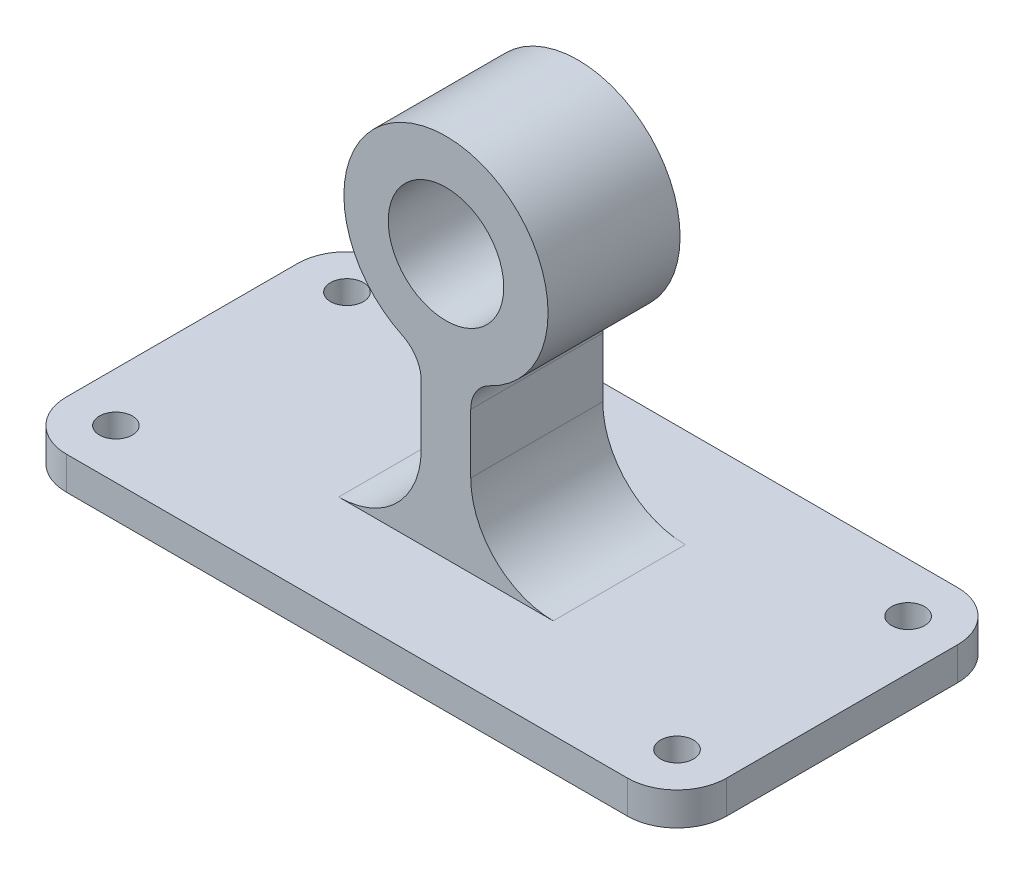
ISO-10303-21;
HEADER;
FILE_DESCRIPTION(('STEP AP214'),'2;1');
FILE_NAME('part.step','',(''),(''),'','','');
FILE_SCHEMA(('AUTOMOTIVE_DESIGN { 1 0 10303 214 1 1 1 1 }'));
ENDSEC;
DATA;
#1=APPLICATION_CONTEXT('core data for automotive mechanical design processes');
#2=APPLICATION_PROTOCOL_DEFINITION('international standard','automotive_design',2000,#1);
#3=PRODUCT_CONTEXT('',#1,'mechanical');
#4=PRODUCT('Part','Part','',(#3));
#5=PRODUCT_RELATED_PRODUCT_CATEGORY('part','',(#4));
#6=PRODUCT_DEFINITION_FORMATION('','',#4);
#7=PRODUCT_DEFINITION_CONTEXT('part definition',#1,'design');
#8=PRODUCT_DEFINITION('design','',#6,#7);
#9=PRODUCT_DEFINITION_SHAPE('','',#8);
#10=(LENGTH_UNIT() NAMED_UNIT(*) SI_UNIT(.MILLI.,.METRE.));
#11=(NAMED_UNIT(*) PLANE_ANGLE_UNIT() SI_UNIT($,.RADIAN.));
#12=(NAMED_UNIT(*) SI_UNIT($,.STERADIAN.) SOLID_ANGLE_UNIT());
#13=UNCERTAINTY_MEASURE_WITH_UNIT(LENGTH_MEASURE(1.E-05),#10,'distance_accuracy_value','');
#14=(GEOMETRIC_REPRESENTATION_CONTEXT(3) GLOBAL_UNCERTAINTY_ASSIGNED_CONTEXT((#13)) GLOBAL_UNIT_ASSIGNED_CONTEXT((#10,
#11,#12)) REPRESENTATION_CONTEXT('',''));
#15=CARTESIAN_POINT('',(0.,0.,0.));
#16=DIRECTION('',(0.,0.,1.));
#17=DIRECTION('',(1.,0.,0.));
#18=AXIS2_PLACEMENT_3D('',#15,#16,#17);
#19=CARTESIAN_POINT('',(15.,10.,-15.));
#20=DIRECTION('',(0.,-1.,0.));
#21=DIRECTION('',(0.,0.,-1.));
#22=AXIS2_PLACEMENT_3D('',#19,#20,#21);
#23=PLANE('',#22);
#24=CARTESIAN_POINT('',(15.,10.,-15.));
#25=DIRECTION('',(0.,1.,0.));
#26=DIRECTION('',(0.,0.,1.));
#27=AXIS2_PLACEMENT_3D('',#24,#25,#26);
#28=CIRCLE('',#27,5.);
#29=CARTESIAN_POINT('',(15.,10.,-10.));
#30=VERTEX_POINT('',#29);
#31=EDGE_CURVE('E246',#30,#30,#28,.T.);
#32=ORIENTED_EDGE('',*,*,#31,.F.);
#33=EDGE_LOOP('',(#32));
#34=FACE_BOUND('',#33,.T.);
#35=CARTESIAN_POINT('',(185.,10.,-85.));
#36=DIRECTION('',(0.,1.,0.));
#37=DIRECTION('',(0.,0.,1.));
#38=AXIS2_PLACEMENT_3D('',#35,#36,#37);
#39=CIRCLE('',#38,5.00000000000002);
#40=CARTESIAN_POINT('',(185.,10.,-80.));
#41=VERTEX_POINT('',#40);
#42=EDGE_CURVE('E255',#41,#41,#39,.T.);
#43=ORIENTED_EDGE('',*,*,#42,.F.);
#44=EDGE_LOOP('',(#43));
#45=FACE_BOUND('',#44,.T.);
#46=CARTESIAN_POINT('',(15.,10.,-85.));
#47=DIRECTION('',(0.,1.,0.));
#48=DIRECTION('',(0.,0.,1.));
#49=AXIS2_PLACEMENT_3D('',#46,#47,#48);
#50=CIRCLE('',#49,5.);
#51=CARTESIAN_POINT('',(15.,10.,-80.));
#52=VERTEX_POINT('',#51);
#53=EDGE_CURVE('E261',#52,#52,#50,.T.);
#54=ORIENTED_EDGE('',*,*,#53,.F.);
#55=EDGE_LOOP('',(#54));
#56=FACE_BOUND('',#55,.T.);
#57=CARTESIAN_POINT('',(185.,10.,-15.));
#58=DIRECTION('',(0.,1.,0.));
#59=DIRECTION('',(0.,0.,1.));
#60=AXIS2_PLACEMENT_3D('',#57,#58,#59);
#61=CIRCLE('',#60,5.00000000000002);
#62=CARTESIAN_POINT('',(185.,10.,-9.99999999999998));
#63=VERTEX_POINT('',#62);
#64=EDGE_CURVE('E267',#63,#63,#61,.T.);
#65=ORIENTED_EDGE('',*,*,#64,.F.);
#66=EDGE_LOOP('',(#65));
#67=FACE_BOUND('',#66,.T.);
#68=CARTESIAN_POINT('',(15.,10.,-15.));
#69=DIRECTION('',(0.,1.,0.));
#70=DIRECTION('',(0.,0.,-1.));
#71=AXIS2_PLACEMENT_3D('',#68,#69,#70);
#72=CIRCLE('',#71,15.);
#73=CARTESIAN_POINT('',(0.,10.,-15.0000000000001));
#74=VERTEX_POINT('',#73);
#75=CARTESIAN_POINT('',(15.0000000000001,10.,0.));
#76=VERTEX_POINT('',#75);
#77=EDGE_CURVE('E161',#74,#76,#72,.T.);
#78=ORIENTED_EDGE('',*,*,#77,.T.);
#79=DIRECTION('',(1.,0.,0.));
#80=VECTOR('',#79,1.);
#81=CARTESIAN_POINT('',(15.0000000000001,10.,0.));
#82=LINE('',#81,#80);
#83=CARTESIAN_POINT('',(185.,10.,0.));
#84=VERTEX_POINT('',#83);
#85=EDGE_CURVE('E150',#76,#84,#82,.T.);
#86=ORIENTED_EDGE('',*,*,#85,.T.);
#87=CARTESIAN_POINT('',(185.,10.,-15.));
#88=DIRECTION('',(0.,1.,0.));
#89=DIRECTION('',(0.,0.,1.));
#90=AXIS2_PLACEMENT_3D('',#87,#88,#89);
#91=CIRCLE('',#90,15.);
#92=CARTESIAN_POINT('',(200.,10.,-15.0000000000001));
#93=VERTEX_POINT('',#92);
#94=EDGE_CURVE('E160',#84,#93,#91,.T.);
#95=ORIENTED_EDGE('',*,*,#94,.T.);
#96=DIRECTION('',(0.,0.,-1.));
#97=VECTOR('',#96,1.);
#98=CARTESIAN_POINT('',(200.,10.,-15.0000000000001));
#99=LINE('',#98,#97);
#100=CARTESIAN_POINT('',(200.,10.,-84.9999999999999));
#101=VERTEX_POINT('',#100);
#102=EDGE_CURVE('E273',#93,#101,#99,.T.);
#103=ORIENTED_EDGE('',*,*,#102,.T.);
#104=CARTESIAN_POINT('',(185.,10.,-85.));
#105=DIRECTION('',(0.,1.,0.));
#106=DIRECTION('',(0.,0.,1.));
#107=AXIS2_PLACEMENT_3D('',#104,#105,#106);
#108=CIRCLE('',#107,15.);
#109=CARTESIAN_POINT('',(185.,10.,-100.));
#110=VERTEX_POINT('',#109);
#111=EDGE_CURVE('E275',#101,#110,#108,.T.);
#112=ORIENTED_EDGE('',*,*,#111,.T.);
#113=DIRECTION('',(-1.,0.,0.));
#114=VECTOR('',#113,1.);
#115=CARTESIAN_POINT('',(15.0000000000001,10.,-100.));
#116=LINE('',#115,#114);
#117=CARTESIAN_POINT('',(15.0000000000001,10.,-100.));
#118=VERTEX_POINT('',#117);
#119=EDGE_CURVE('E277',#110,#118,#116,.T.);
#120=ORIENTED_EDGE('',*,*,#119,.T.);
#121=CARTESIAN_POINT('',(15.,10.,-85.));
#122=DIRECTION('',(0.,1.,0.));
#123=DIRECTION('',(0.,0.,-1.));
#124=AXIS2_PLACEMENT_3D('',#121,#122,#123);
#125=CIRCLE('',#124,15.);
#126=CARTESIAN_POINT('',(0.,10.,-84.9999999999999));
#127=VERTEX_POINT('',#126);
#128=EDGE_CURVE('E279',#118,#127,#125,.T.);
#129=ORIENTED_EDGE('',*,*,#128,.T.);
#130=DIRECTION('',(0.,0.,1.));
#131=VECTOR('',#130,1.);
#132=CARTESIAN_POINT('',(0.,10.,-15.0000000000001));
#133=LINE('',#132,#131);
#134=EDGE_CURVE('E166',#127,#74,#133,.T.);
#135=ORIENTED_EDGE('',*,*,#134,.T.);
#136=EDGE_LOOP('',(#78,#86,#95,#103,#112,#120,#129,#135));
#137=FACE_BOUND('',#136,.T.);
#138=DIRECTION('',(1.,0.,0.));
#139=VECTOR('',#138,1.);
#140=CARTESIAN_POINT('',(92.5,10.,-30.));
#141=LINE('',#140,#139);
#142=CARTESIAN_POINT('',(67.5,10.,-30.));
#143=VERTEX_POINT('',#142);
#144=CARTESIAN_POINT('',(132.5,10.,-30.));
#145=VERTEX_POINT('',#144);
#146=EDGE_CURVE('E569',#143,#145,#141,.T.);
#147=ORIENTED_EDGE('',*,*,#146,.F.);
#148=DIRECTION('',(0.,0.,1.));
#149=VECTOR('',#148,1.);
#150=CARTESIAN_POINT('',(67.5,10.,-70.));
#151=LINE('',#150,#149);
#152=CARTESIAN_POINT('',(67.5,10.,-70.));
#153=VERTEX_POINT('',#152);
#154=EDGE_CURVE('E186',#143,#153,#151,.F.);
#155=ORIENTED_EDGE('',*,*,#154,.T.);
#156=DIRECTION('',(-1.,0.,0.));
#157=VECTOR('',#156,1.);
#158=CARTESIAN_POINT('',(92.5,10.,-70.));
#159=LINE('',#158,#157);
#160=CARTESIAN_POINT('',(132.5,10.,-70.));
#161=VERTEX_POINT('',#160);
#162=EDGE_CURVE('E566',#161,#153,#159,.T.);
#163=ORIENTED_EDGE('',*,*,#162,.F.);
#164=DIRECTION('',(0.,0.,-1.));
#165=VECTOR('',#164,1.);
#166=CARTESIAN_POINT('',(132.5,10.,-30.));
#167=LINE('',#166,#165);
#168=EDGE_CURVE('E178',#161,#145,#167,.F.);
#169=ORIENTED_EDGE('',*,*,#168,.T.);
#170=EDGE_LOOP('',(#147,#155,#163,#169));
#171=FACE_BOUND('',#170,.T.);
#172=ADVANCED_FACE('F39',(#34,#45,#56,#67,#137,#171),#23,.F.);
#173=CARTESIAN_POINT('',(15.,0.,-15.));
#174=DIRECTION('',(0.,-1.,0.));
#175=DIRECTION('',(0.,0.,-1.));
#176=AXIS2_PLACEMENT_3D('',#173,#174,#175);
#177=PLANE('',#176);
#178=CARTESIAN_POINT('',(185.,0.,-85.));
#179=DIRECTION('',(0.,1.,0.));
#180=DIRECTION('',(0.,0.,1.));
#181=AXIS2_PLACEMENT_3D('',#178,#179,#180);
#182=CIRCLE('',#181,5.00000000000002);
#183=CARTESIAN_POINT('',(185.,0.,-80.));
#184=VERTEX_POINT('',#183);
#185=EDGE_CURVE('E253',#184,#184,#182,.T.);
#186=ORIENTED_EDGE('',*,*,#185,.T.);
#187=EDGE_LOOP('',(#186));
#188=FACE_BOUND('',#187,.T.);
#189=CARTESIAN_POINT('',(185.,0.,-15.));
#190=DIRECTION('',(0.,1.,0.));
#191=DIRECTION('',(0.,0.,1.));
#192=AXIS2_PLACEMENT_3D('',#189,#190,#191);
#193=CIRCLE('',#192,5.00000000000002);
#194=CARTESIAN_POINT('',(185.,0.,-9.99999999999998));
#195=VERTEX_POINT('',#194);
#196=EDGE_CURVE('E264',#195,#195,#193,.T.);
#197=ORIENTED_EDGE('',*,*,#196,.T.);
#198=EDGE_LOOP('',(#197));
#199=FACE_BOUND('',#198,.T.);
#200=CARTESIAN_POINT('',(15.,0.,-15.));
#201=DIRECTION('',(0.,1.,0.));
#202=DIRECTION('',(0.,0.,-1.));
#203=AXIS2_PLACEMENT_3D('',#200,#201,#202);
#204=CIRCLE('',#203,15.);
#205=CARTESIAN_POINT('',(0.,0.,-15.0000000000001));
#206=VERTEX_POINT('',#205);
#207=CARTESIAN_POINT('',(15.0000000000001,0.,0.));
#208=VERTEX_POINT('',#207);
#209=EDGE_CURVE('E174',#206,#208,#204,.T.);
#210=ORIENTED_EDGE('',*,*,#209,.F.);
#211=DIRECTION('',(0.,0.,1.));
#212=VECTOR('',#211,1.);
#213=CARTESIAN_POINT('',(0.,0.,-15.0000000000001));
#214=LINE('',#213,#212);
#215=CARTESIAN_POINT('',(0.,0.,-84.9999999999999));
#216=VERTEX_POINT('',#215);
#217=EDGE_CURVE('E170',#216,#206,#214,.T.);
#218=ORIENTED_EDGE('',*,*,#217,.F.);
#219=CARTESIAN_POINT('',(15.,0.,-85.));
#220=DIRECTION('',(0.,1.,0.));
#221=DIRECTION('',(0.,0.,-1.));
#222=AXIS2_PLACEMENT_3D('',#219,#220,#221);
#223=CIRCLE('',#222,15.);
#224=CARTESIAN_POINT('',(15.0000000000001,0.,-100.));
#225=VERTEX_POINT('',#224);
#226=EDGE_CURVE('E294',#225,#216,#223,.T.);
#227=ORIENTED_EDGE('',*,*,#226,.F.);
#228=DIRECTION('',(-1.,0.,0.));
#229=VECTOR('',#228,1.);
#230=CARTESIAN_POINT('',(15.0000000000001,0.,-100.));
#231=LINE('',#230,#229);
#232=CARTESIAN_POINT('',(185.,0.,-100.));
#233=VERTEX_POINT('',#232);
#234=EDGE_CURVE('E292',#233,#225,#231,.T.);
#235=ORIENTED_EDGE('',*,*,#234,.F.);
#236=CARTESIAN_POINT('',(185.,0.,-85.));
#237=DIRECTION('',(0.,1.,0.));
#238=DIRECTION('',(0.,0.,1.));
#239=AXIS2_PLACEMENT_3D('',#236,#237,#238);
#240=CIRCLE('',#239,15.);
#241=CARTESIAN_POINT('',(200.,0.,-84.9999999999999));
#242=VERTEX_POINT('',#241);
#243=EDGE_CURVE('E290',#242,#233,#240,.T.);
#244=ORIENTED_EDGE('',*,*,#243,.F.);
#245=DIRECTION('',(0.,0.,-1.));
#246=VECTOR('',#245,1.);
#247=CARTESIAN_POINT('',(200.,0.,-15.0000000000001));
#248=LINE('',#247,#246);
#249=CARTESIAN_POINT('',(200.,0.,-15.0000000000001));
#250=VERTEX_POINT('',#249);
#251=EDGE_CURVE('E288',#250,#242,#248,.T.);
#252=ORIENTED_EDGE('',*,*,#251,.F.);
#253=CARTESIAN_POINT('',(185.,0.,-15.));
#254=DIRECTION('',(0.,1.,0.));
#255=DIRECTION('',(0.,0.,1.));
#256=AXIS2_PLACEMENT_3D('',#253,#254,#255);
#257=CIRCLE('',#256,15.);
#258=CARTESIAN_POINT('',(185.,0.,0.));
#259=VERTEX_POINT('',#258);
#260=EDGE_CURVE('E286',#259,#250,#257,.T.);
#261=ORIENTED_EDGE('',*,*,#260,.F.);
#262=DIRECTION('',(1.,0.,0.));
#263=VECTOR('',#262,1.);
#264=CARTESIAN_POINT('',(15.0000000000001,0.,0.));
#265=LINE('',#264,#263);
#266=EDGE_CURVE('E284',#208,#259,#265,.T.);
#267=ORIENTED_EDGE('',*,*,#266,.F.);
#268=EDGE_LOOP('',(#210,#218,#227,#235,#244,#252,#261,#267));
#269=FACE_BOUND('',#268,.T.);
#270=CARTESIAN_POINT('',(15.,0.,-85.));
#271=DIRECTION('',(0.,1.,0.));
#272=DIRECTION('',(0.,0.,1.));
#273=AXIS2_PLACEMENT_3D('',#270,#271,#272);
#274=CIRCLE('',#273,5.);
#275=CARTESIAN_POINT('',(15.,0.,-80.));
#276=VERTEX_POINT('',#275);
#277=EDGE_CURVE('E258',#276,#276,#274,.T.);
#278=ORIENTED_EDGE('',*,*,#277,.T.);
#279=EDGE_LOOP('',(#278));
#280=FACE_BOUND('',#279,.T.);
#281=CARTESIAN_POINT('',(15.,0.,-15.));
#282=DIRECTION('',(0.,1.,0.));
#283=DIRECTION('',(0.,0.,1.));
#284=AXIS2_PLACEMENT_3D('',#281,#282,#283);
#285=CIRCLE('',#284,5.);
#286=CARTESIAN_POINT('',(15.,0.,-10.));
#287=VERTEX_POINT('',#286);
#288=EDGE_CURVE('E242',#287,#287,#285,.T.);
#289=ORIENTED_EDGE('',*,*,#288,.T.);
#290=EDGE_LOOP('',(#289));
#291=FACE_BOUND('',#290,.T.);
#292=ADVANCED_FACE('F320',(#188,#199,#269,#280,#291),#177,.T.);
#293=CARTESIAN_POINT('',(15.,10.,-15.));
#294=DIRECTION('',(0.,-1.,0.));
#295=DIRECTION('',(0.,0.,-1.));
#296=AXIS2_PLACEMENT_3D('',#293,#294,#295);
#297=CYLINDRICAL_SURFACE('',#296,15.);
#298=ORIENTED_EDGE('',*,*,#209,.T.);
#299=DIRECTION('',(0.,-1.,0.));
#300=VECTOR('',#299,1.);
#301=CARTESIAN_POINT('',(15.0000000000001,10.,0.));
#302=LINE('',#301,#300);
#303=EDGE_CURVE('E154',#76,#208,#302,.T.);
#304=ORIENTED_EDGE('',*,*,#303,.F.);
#305=ORIENTED_EDGE('',*,*,#77,.F.);
#306=DIRECTION('',(0.,-1.,0.));
#307=VECTOR('',#306,1.);
#308=CARTESIAN_POINT('',(0.,10.,-15.0000000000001));
#309=LINE('',#308,#307);
#310=EDGE_CURVE('E282',#74,#206,#309,.T.);
#311=ORIENTED_EDGE('',*,*,#310,.T.);
#312=EDGE_LOOP('',(#298,#304,#305,#311));
#313=FACE_BOUND('',#312,.T.);
#314=ADVANCED_FACE('F172',(#313),#297,.T.);
#315=CARTESIAN_POINT('',(15.0000000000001,10.,0.));
#316=DIRECTION('',(0.,0.,-1.));
#317=DIRECTION('',(-1.,0.,0.));
#318=AXIS2_PLACEMENT_3D('',#315,#316,#317);
#319=PLANE('',#318);
#320=ORIENTED_EDGE('',*,*,#266,.T.);
#321=DIRECTION('',(0.,-1.,0.));
#322=VECTOR('',#321,1.);
#323=CARTESIAN_POINT('',(185.,10.,0.));
#324=LINE('',#323,#322);
#325=EDGE_CURVE('E157',#84,#259,#324,.T.);
#326=ORIENTED_EDGE('',*,*,#325,.F.);
#327=ORIENTED_EDGE('',*,*,#85,.F.);
#328=ORIENTED_EDGE('',*,*,#303,.T.);
#329=EDGE_LOOP('',(#320,#326,#327,#328));
#330=FACE_BOUND('',#329,.T.);
#331=ADVANCED_FACE('F152',(#330),#319,.F.);
#332=CARTESIAN_POINT('',(185.,10.,-15.));
#333=DIRECTION('',(0.,-1.,0.));
#334=DIRECTION('',(0.,0.,-1.));
#335=AXIS2_PLACEMENT_3D('',#332,#333,#334);
#336=CYLINDRICAL_SURFACE('',#335,15.);
#337=ORIENTED_EDGE('',*,*,#260,.T.);
#338=DIRECTION('',(0.,-1.,0.));
#339=VECTOR('',#338,1.);
#340=CARTESIAN_POINT('',(200.,10.,-15.0000000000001));
#341=LINE('',#340,#339);
#342=EDGE_CURVE('E180',#93,#250,#341,.T.);
#343=ORIENTED_EDGE('',*,*,#342,.F.);
#344=ORIENTED_EDGE('',*,*,#94,.F.);
#345=ORIENTED_EDGE('',*,*,#325,.T.);
#346=EDGE_LOOP('',(#337,#343,#344,#345));
#347=FACE_BOUND('',#346,.T.);
#348=ADVANCED_FACE('F334',(#347),#336,.T.);
#349=CARTESIAN_POINT('',(200.,10.,-15.0000000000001));
#350=DIRECTION('',(-1.,0.,0.));
#351=DIRECTION('',(0.,0.,1.));
#352=AXIS2_PLACEMENT_3D('',#349,#350,#351);
#353=PLANE('',#352);
#354=ORIENTED_EDGE('',*,*,#251,.T.);
#355=DIRECTION('',(0.,-1.,0.));
#356=VECTOR('',#355,1.);
#357=CARTESIAN_POINT('',(200.,10.,-84.9999999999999));
#358=LINE('',#357,#356);
#359=EDGE_CURVE('E307',#101,#242,#358,.T.);
#360=ORIENTED_EDGE('',*,*,#359,.F.);
#361=ORIENTED_EDGE('',*,*,#102,.F.);
#362=ORIENTED_EDGE('',*,*,#342,.T.);
#363=EDGE_LOOP('',(#354,#360,#361,#362));
#364=FACE_BOUND('',#363,.T.);
#365=ADVANCED_FACE('F314',(#364),#353,.F.);
#366=CARTESIAN_POINT('',(185.,10.,-85.));
#367=DIRECTION('',(0.,-1.,0.));
#368=DIRECTION('',(0.,0.,-1.));
#369=AXIS2_PLACEMENT_3D('',#366,#367,#368);
#370=CYLINDRICAL_SURFACE('',#369,15.);
#371=ORIENTED_EDGE('',*,*,#243,.T.);
#372=DIRECTION('',(0.,-1.,0.));
#373=VECTOR('',#372,1.);
#374=CARTESIAN_POINT('',(185.,10.,-100.));
#375=LINE('',#374,#373);
#376=EDGE_CURVE('E304',#110,#233,#375,.T.);
#377=ORIENTED_EDGE('',*,*,#376,.F.);
#378=ORIENTED_EDGE('',*,*,#111,.F.);
#379=ORIENTED_EDGE('',*,*,#359,.T.);
#380=EDGE_LOOP('',(#371,#377,#378,#379));
#381=FACE_BOUND('',#380,.T.);
#382=ADVANCED_FACE('F326',(#381),#370,.T.);
#383=CARTESIAN_POINT('',(15.0000000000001,10.,-100.));
#384=DIRECTION('',(0.,0.,1.));
#385=DIRECTION('',(1.,0.,0.));
#386=AXIS2_PLACEMENT_3D('',#383,#384,#385);
#387=PLANE('',#386);
#388=ORIENTED_EDGE('',*,*,#234,.T.);
#389=DIRECTION('',(0.,-1.,0.));
#390=VECTOR('',#389,1.);
#391=CARTESIAN_POINT('',(15.0000000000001,10.,-100.));
#392=LINE('',#391,#390);
#393=EDGE_CURVE('E301',#118,#225,#392,.T.);
#394=ORIENTED_EDGE('',*,*,#393,.F.);
#395=ORIENTED_EDGE('',*,*,#119,.F.);
#396=ORIENTED_EDGE('',*,*,#376,.T.);
#397=EDGE_LOOP('',(#388,#394,#395,#396));
#398=FACE_BOUND('',#397,.T.);
#399=ADVANCED_FACE('F330',(#398),#387,.F.);
#400=CARTESIAN_POINT('',(15.,10.,-85.));
#401=DIRECTION('',(0.,-1.,0.));
#402=DIRECTION('',(0.,0.,-1.));
#403=AXIS2_PLACEMENT_3D('',#400,#401,#402);
#404=CYLINDRICAL_SURFACE('',#403,15.);
#405=ORIENTED_EDGE('',*,*,#226,.T.);
#406=DIRECTION('',(0.,-1.,0.));
#407=VECTOR('',#406,1.);
#408=CARTESIAN_POINT('',(0.,10.,-84.9999999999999));
#409=LINE('',#408,#407);
#410=EDGE_CURVE('E298',#127,#216,#409,.T.);
#411=ORIENTED_EDGE('',*,*,#410,.F.);
#412=ORIENTED_EDGE('',*,*,#128,.F.);
#413=ORIENTED_EDGE('',*,*,#393,.T.);
#414=EDGE_LOOP('',(#405,#411,#412,#413));
#415=FACE_BOUND('',#414,.T.);
#416=ADVANCED_FACE('F360',(#415),#404,.T.);
#417=CARTESIAN_POINT('',(0.,10.,-15.0000000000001));
#418=DIRECTION('',(1.,0.,0.));
#419=DIRECTION('',(0.,0.,-1.));
#420=AXIS2_PLACEMENT_3D('',#417,#418,#419);
#421=PLANE('',#420);
#422=ORIENTED_EDGE('',*,*,#217,.T.);
#423=ORIENTED_EDGE('',*,*,#310,.F.);
#424=ORIENTED_EDGE('',*,*,#134,.F.);
#425=ORIENTED_EDGE('',*,*,#410,.T.);
#426=EDGE_LOOP('',(#422,#423,#424,#425));
#427=FACE_BOUND('',#426,.T.);
#428=ADVANCED_FACE('F357',(#427),#421,.F.);
#429=CARTESIAN_POINT('',(185.,10.,-15.));
#430=DIRECTION('',(0.,-1.,0.));
#431=DIRECTION('',(0.,0.,-1.));
#432=AXIS2_PLACEMENT_3D('',#429,#430,#431);
#433=CYLINDRICAL_SURFACE('',#432,5.00000000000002);
#434=ORIENTED_EDGE('',*,*,#64,.T.);
#435=EDGE_LOOP('',(#434));
#436=FACE_BOUND('',#435,.T.);
#437=ORIENTED_EDGE('',*,*,#196,.F.);
#438=EDGE_LOOP('',(#437));
#439=FACE_BOUND('',#438,.T.);
#440=ADVANCED_FACE('F354',(#436,#439),#433,.F.);
#441=CARTESIAN_POINT('',(15.,10.,-85.));
#442=DIRECTION('',(0.,-1.,0.));
#443=DIRECTION('',(0.,0.,-1.));
#444=AXIS2_PLACEMENT_3D('',#441,#442,#443);
#445=CYLINDRICAL_SURFACE('',#444,5.);
#446=ORIENTED_EDGE('',*,*,#53,.T.);
#447=EDGE_LOOP('',(#446));
#448=FACE_BOUND('',#447,.T.);
#449=ORIENTED_EDGE('',*,*,#277,.F.);
#450=EDGE_LOOP('',(#449));
#451=FACE_BOUND('',#450,.T.);
#452=ADVANCED_FACE('F390',(#448,#451),#445,.F.);
#453=CARTESIAN_POINT('',(185.,10.,-85.));
#454=DIRECTION('',(0.,-1.,0.));
#455=DIRECTION('',(0.,0.,-1.));
#456=AXIS2_PLACEMENT_3D('',#453,#454,#455);
#457=CYLINDRICAL_SURFACE('',#456,5.00000000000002);
#458=ORIENTED_EDGE('',*,*,#42,.T.);
#459=EDGE_LOOP('',(#458));
#460=FACE_BOUND('',#459,.T.);
#461=ORIENTED_EDGE('',*,*,#185,.F.);
#462=EDGE_LOOP('',(#461));
#463=FACE_BOUND('',#462,.T.);
#464=ADVANCED_FACE('F397',(#460,#463),#457,.F.);
#465=CARTESIAN_POINT('',(15.,10.,-15.));
#466=DIRECTION('',(0.,-1.,0.));
#467=DIRECTION('',(0.,0.,-1.));
#468=AXIS2_PLACEMENT_3D('',#465,#466,#467);
#469=CYLINDRICAL_SURFACE('',#468,5.);
#470=ORIENTED_EDGE('',*,*,#31,.T.);
#471=EDGE_LOOP('',(#470));
#472=FACE_BOUND('',#471,.T.);
#473=ORIENTED_EDGE('',*,*,#288,.F.);
#474=EDGE_LOOP('',(#473));
#475=FACE_BOUND('',#474,.T.);
#476=ADVANCED_FACE('F404',(#472,#475),#469,.F.);
#477=CARTESIAN_POINT('',(107.5,60.,-30.));
#478=DIRECTION('',(-1.,0.,0.));
#479=DIRECTION('',(0.,0.,1.));
#480=AXIS2_PLACEMENT_3D('',#477,#478,#479);
#481=PLANE('',#480);
#482=DIRECTION('',(0.,-1.,0.));
#483=VECTOR('',#482,1.);
#484=CARTESIAN_POINT('',(107.5,60.,-70.));
#485=LINE('',#484,#483);
#486=CARTESIAN_POINT('',(107.5,53.0072190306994,-70.));
#487=VERTEX_POINT('',#486);
#488=CARTESIAN_POINT('',(107.5,35.,-70.));
#489=VERTEX_POINT('',#488);
#490=EDGE_CURVE('E237',#487,#489,#485,.T.);
#491=ORIENTED_EDGE('',*,*,#490,.F.);
#492=DIRECTION('',(0.,0.,1.));
#493=VECTOR('',#492,1.);
#494=CARTESIAN_POINT('',(107.5,53.0072190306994,-30.));
#495=LINE('',#494,#493);
#496=CARTESIAN_POINT('',(107.5,53.0072190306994,-30.));
#497=VERTEX_POINT('',#496);
#498=EDGE_CURVE('E210',#487,#497,#495,.T.);
#499=ORIENTED_EDGE('',*,*,#498,.T.);
#500=DIRECTION('',(0.,-1.,0.));
#501=VECTOR('',#500,1.);
#502=CARTESIAN_POINT('',(107.5,60.,-30.));
#503=LINE('',#502,#501);
#504=CARTESIAN_POINT('',(107.5,35.,-30.));
#505=VERTEX_POINT('',#504);
#506=EDGE_CURVE('E221',#497,#505,#503,.T.);
#507=ORIENTED_EDGE('',*,*,#506,.T.);
#508=DIRECTION('',(0.,0.,-1.));
#509=VECTOR('',#508,1.);
#510=CARTESIAN_POINT('',(107.5,35.,-70.));
#511=LINE('',#510,#509);
#512=EDGE_CURVE('E189',#505,#489,#511,.T.);
#513=ORIENTED_EDGE('',*,*,#512,.T.);
#514=EDGE_LOOP('',(#491,#499,#507,#513));
#515=FACE_BOUND('',#514,.T.);
#516=ADVANCED_FACE('F240',(#515),#481,.F.);
#517=CARTESIAN_POINT('',(92.5,60.,-70.));
#518=DIRECTION('',(0.,0.,1.));
#519=DIRECTION('',(1.,0.,0.));
#520=AXIS2_PLACEMENT_3D('',#517,#518,#519);
#521=PLANE('',#520);
#522=CARTESIAN_POINT('',(100.,90.,-70.));
#523=DIRECTION('',(0.,0.,1.));
#524=DIRECTION('',(1.,0.,0.));
#525=AXIS2_PLACEMENT_3D('',#522,#523,#524);
#526=CIRCLE('',#525,17.5);
#527=CARTESIAN_POINT('',(117.5,90.,-70.));
#528=VERTEX_POINT('',#527);
#529=EDGE_CURVE('E231',#528,#528,#526,.T.);
#530=ORIENTED_EDGE('',*,*,#529,.T.);
#531=EDGE_LOOP('',(#530));
#532=FACE_BOUND('',#531,.T.);
#533=DIRECTION('',(0.,-1.,0.));
#534=VECTOR('',#533,1.);
#535=CARTESIAN_POINT('',(92.5,60.,-70.));
#536=LINE('',#535,#534);
#537=CARTESIAN_POINT('',(92.5,53.0072190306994,-70.));
#538=VERTEX_POINT('',#537);
#539=CARTESIAN_POINT('',(92.5,35.,-70.));
#540=VERTEX_POINT('',#539);
#541=EDGE_CURVE('E243',#538,#540,#536,.T.);
#542=ORIENTED_EDGE('',*,*,#541,.F.);
#543=CARTESIAN_POINT('',(82.5,53.0072190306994,-70.));
#544=DIRECTION('',(0.,0.,1.));
#545=DIRECTION('',(1.,0.,0.));
#546=AXIS2_PLACEMENT_3D('',#543,#544,#545);
#547=CIRCLE('',#546,10.);
#548=CARTESIAN_POINT('',(86.7762932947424,62.0467608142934,-70.));
#549=VERTEX_POINT('',#548);
#550=EDGE_CURVE('E11',#538,#549,#547,.T.);
#551=ORIENTED_EDGE('',*,*,#550,.T.);
#552=CARTESIAN_POINT('',(100.,90.,-70.));
#553=DIRECTION('',(0.,0.,1.));
#554=DIRECTION('',(1.,0.,0.));
#555=AXIS2_PLACEMENT_3D('',#552,#553,#554);
#556=CIRCLE('',#555,30.9232921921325);
#557=CARTESIAN_POINT('',(113.223706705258,62.0467608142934,-70.));
#558=VERTEX_POINT('',#557);
#559=EDGE_CURVE('E230',#558,#549,#556,.T.);
#560=ORIENTED_EDGE('',*,*,#559,.F.);
#561=CARTESIAN_POINT('',(117.5,53.0072190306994,-70.));
#562=DIRECTION('',(0.,0.,1.));
#563=DIRECTION('',(1.,0.,0.));
#564=AXIS2_PLACEMENT_3D('',#561,#562,#563);
#565=CIRCLE('',#564,10.);
#566=EDGE_CURVE('E213',#558,#487,#565,.T.);
#567=ORIENTED_EDGE('',*,*,#566,.T.);
#568=ORIENTED_EDGE('',*,*,#490,.T.);
#569=CARTESIAN_POINT('',(132.5,35.,-70.));
#570=DIRECTION('',(0.,0.,1.));
#571=DIRECTION('',(1.,0.,0.));
#572=AXIS2_PLACEMENT_3D('',#569,#570,#571);
#573=CIRCLE('',#572,25.);
#574=EDGE_CURVE('E198',#489,#161,#573,.T.);
#575=ORIENTED_EDGE('',*,*,#574,.T.);
#576=ORIENTED_EDGE('',*,*,#162,.T.);
#577=CARTESIAN_POINT('',(67.5,35.,-70.));
#578=DIRECTION('',(0.,0.,1.));
#579=DIRECTION('',(1.,0.,0.));
#580=AXIS2_PLACEMENT_3D('',#577,#578,#579);
#581=CIRCLE('',#580,25.);
#582=EDGE_CURVE('E195',#153,#540,#581,.T.);
#583=ORIENTED_EDGE('',*,*,#582,.T.);
#584=EDGE_LOOP('',(#542,#551,#560,#567,#568,#575,#576,#583));
#585=FACE_BOUND('',#584,.T.);
#586=ADVANCED_FACE('F236',(#532,#585),#521,.F.);
#587=CARTESIAN_POINT('',(92.5,60.,-30.));
#588=DIRECTION('',(1.,0.,0.));
#589=DIRECTION('',(0.,0.,-1.));
#590=AXIS2_PLACEMENT_3D('',#587,#588,#589);
#591=PLANE('',#590);
#592=DIRECTION('',(0.,-1.,0.));
#593=VECTOR('',#592,1.);
#594=CARTESIAN_POINT('',(92.5,60.,-30.));
#595=LINE('',#594,#593);
#596=CARTESIAN_POINT('',(92.5,53.0072190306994,-30.));
#597=VERTEX_POINT('',#596);
#598=CARTESIAN_POINT('',(92.5,35.,-30.));
#599=VERTEX_POINT('',#598);
#600=EDGE_CURVE('E248',#597,#599,#595,.T.);
#601=ORIENTED_EDGE('',*,*,#600,.F.);
#602=DIRECTION('',(0.,0.,1.));
#603=VECTOR('',#602,1.);
#604=CARTESIAN_POINT('',(92.5,53.0072190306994,-30.));
#605=LINE('',#604,#603);
#606=EDGE_CURVE('E60',#597,#538,#605,.F.);
#607=ORIENTED_EDGE('',*,*,#606,.T.);
#608=ORIENTED_EDGE('',*,*,#541,.T.);
#609=DIRECTION('',(0.,0.,1.));
#610=VECTOR('',#609,1.);
#611=CARTESIAN_POINT('',(92.5,35.,-30.));
#612=LINE('',#611,#610);
#613=EDGE_CURVE('E175',#540,#599,#612,.T.);
#614=ORIENTED_EDGE('',*,*,#613,.T.);
#615=EDGE_LOOP('',(#601,#607,#608,#614));
#616=FACE_BOUND('',#615,.T.);
#617=ADVANCED_FACE('F427',(#616),#591,.F.);
#618=CARTESIAN_POINT('',(92.5,60.,-30.));
#619=DIRECTION('',(0.,0.,-1.));
#620=DIRECTION('',(-1.,0.,0.));
#621=AXIS2_PLACEMENT_3D('',#618,#619,#620);
#622=PLANE('',#621);
#623=CARTESIAN_POINT('',(100.,90.,-30.));
#624=DIRECTION('',(0.,0.,1.));
#625=DIRECTION('',(1.,0.,0.));
#626=AXIS2_PLACEMENT_3D('',#623,#624,#625);
#627=CIRCLE('',#626,17.5);
#628=CARTESIAN_POINT('',(117.5,90.,-30.));
#629=VERTEX_POINT('',#628);
#630=EDGE_CURVE('E562',#629,#629,#627,.T.);
#631=ORIENTED_EDGE('',*,*,#630,.F.);
#632=EDGE_LOOP('',(#631));
#633=FACE_BOUND('',#632,.T.);
#634=ORIENTED_EDGE('',*,*,#506,.F.);
#635=CARTESIAN_POINT('',(117.5,53.0072190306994,-30.));
#636=DIRECTION('',(0.,0.,-1.));
#637=DIRECTION('',(-1.,0.,0.));
#638=AXIS2_PLACEMENT_3D('',#635,#636,#637);
#639=CIRCLE('',#638,10.);
#640=CARTESIAN_POINT('',(113.223706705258,62.0467608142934,-30.));
#641=VERTEX_POINT('',#640);
#642=EDGE_CURVE('E215',#497,#641,#639,.T.);
#643=ORIENTED_EDGE('',*,*,#642,.T.);
#644=CARTESIAN_POINT('',(100.,90.,-30.));
#645=DIRECTION('',(0.,0.,1.));
#646=DIRECTION('',(1.,0.,0.));
#647=AXIS2_PLACEMENT_3D('',#644,#645,#646);
#648=CIRCLE('',#647,30.9232921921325);
#649=CARTESIAN_POINT('',(86.7762932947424,62.0467608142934,-30.));
#650=VERTEX_POINT('',#649);
#651=EDGE_CURVE('E220',#641,#650,#648,.T.);
#652=ORIENTED_EDGE('',*,*,#651,.T.);
#653=CARTESIAN_POINT('',(82.5,53.0072190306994,-30.));
#654=DIRECTION('',(0.,0.,-1.));
#655=DIRECTION('',(-1.,0.,0.));
#656=AXIS2_PLACEMENT_3D('',#653,#654,#655);
#657=CIRCLE('',#656,10.);
#658=EDGE_CURVE('E47',#650,#597,#657,.T.);
#659=ORIENTED_EDGE('',*,*,#658,.T.);
#660=ORIENTED_EDGE('',*,*,#600,.T.);
#661=CARTESIAN_POINT('',(67.5,35.,-30.));
#662=DIRECTION('',(0.,0.,-1.));
#663=DIRECTION('',(-1.,0.,0.));
#664=AXIS2_PLACEMENT_3D('',#661,#662,#663);
#665=CIRCLE('',#664,25.);
#666=EDGE_CURVE('E192',#599,#143,#665,.T.);
#667=ORIENTED_EDGE('',*,*,#666,.T.);
#668=ORIENTED_EDGE('',*,*,#146,.T.);
#669=CARTESIAN_POINT('',(132.5,35.,-30.));
#670=DIRECTION('',(0.,0.,-1.));
#671=DIRECTION('',(-1.,0.,0.));
#672=AXIS2_PLACEMENT_3D('',#669,#670,#671);
#673=CIRCLE('',#672,25.);
#674=EDGE_CURVE('E201',#145,#505,#673,.T.);
#675=ORIENTED_EDGE('',*,*,#674,.T.);
#676=EDGE_LOOP('',(#634,#643,#652,#659,#660,#667,#668,#675));
#677=FACE_BOUND('',#676,.T.);
#678=ADVANCED_FACE('F219',(#633,#677),#622,.F.);
#679=CARTESIAN_POINT('',(67.5,35.,-30.));
#680=DIRECTION('',(0.,0.,-1.));
#681=DIRECTION('',(-1.,0.,0.));
#682=AXIS2_PLACEMENT_3D('',#679,#680,#681);
#683=CYLINDRICAL_SURFACE('',#682,25.);
#684=ORIENTED_EDGE('',*,*,#582,.F.);
#685=ORIENTED_EDGE('',*,*,#154,.F.);
#686=ORIENTED_EDGE('',*,*,#666,.F.);
#687=ORIENTED_EDGE('',*,*,#613,.F.);
#688=EDGE_LOOP('',(#684,#685,#686,#687));
#689=FACE_BOUND('',#688,.T.);
#690=ADVANCED_FACE('F442',(#689),#683,.F.);
#691=CARTESIAN_POINT('',(132.5,35.,-30.));
#692=DIRECTION('',(0.,0.,1.));
#693=DIRECTION('',(1.,0.,0.));
#694=AXIS2_PLACEMENT_3D('',#691,#692,#693);
#695=CYLINDRICAL_SURFACE('',#694,25.);
#696=ORIENTED_EDGE('',*,*,#674,.F.);
#697=ORIENTED_EDGE('',*,*,#168,.F.);
#698=ORIENTED_EDGE('',*,*,#574,.F.);
#699=ORIENTED_EDGE('',*,*,#512,.F.);
#700=EDGE_LOOP('',(#696,#697,#698,#699));
#701=FACE_BOUND('',#700,.T.);
#702=ADVANCED_FACE('F451',(#701),#695,.F.);
#703=CARTESIAN_POINT('',(100.,90.,-70.));
#704=DIRECTION('',(0.,0.,1.));
#705=DIRECTION('',(1.,0.,0.));
#706=AXIS2_PLACEMENT_3D('',#703,#704,#705);
#707=CYLINDRICAL_SURFACE('',#706,30.9232921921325);
#708=ORIENTED_EDGE('',*,*,#651,.F.);
#709=DIRECTION('',(0.,0.,1.));
#710=VECTOR('',#709,1.);
#711=CARTESIAN_POINT('',(113.223706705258,62.0467608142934,-70.));
#712=LINE('',#711,#710);
#713=EDGE_CURVE('E207',#641,#558,#712,.F.);
#714=ORIENTED_EDGE('',*,*,#713,.T.);
#715=ORIENTED_EDGE('',*,*,#559,.T.);
#716=DIRECTION('',(0.,0.,1.));
#717=VECTOR('',#716,1.);
#718=CARTESIAN_POINT('',(86.7762932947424,62.0467608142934,-70.));
#719=LINE('',#718,#717);
#720=EDGE_CURVE('E204',#549,#650,#719,.T.);
#721=ORIENTED_EDGE('',*,*,#720,.T.);
#722=EDGE_LOOP('',(#708,#714,#715,#721));
#723=FACE_BOUND('',#722,.T.);
#724=ADVANCED_FACE('F226',(#723),#707,.T.);
#725=CARTESIAN_POINT('',(117.5,53.0072190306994,-70.));
#726=DIRECTION('',(0.,0.,1.));
#727=DIRECTION('',(1.,0.,0.));
#728=AXIS2_PLACEMENT_3D('',#725,#726,#727);
#729=CYLINDRICAL_SURFACE('',#728,10.);
#730=ORIENTED_EDGE('',*,*,#642,.F.);
#731=ORIENTED_EDGE('',*,*,#498,.F.);
#732=ORIENTED_EDGE('',*,*,#566,.F.);
#733=ORIENTED_EDGE('',*,*,#713,.F.);
#734=EDGE_LOOP('',(#730,#731,#732,#733));
#735=FACE_BOUND('',#734,.T.);
#736=ADVANCED_FACE('F233',(#735),#729,.F.);
#737=CARTESIAN_POINT('',(82.5,53.0072190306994,-70.));
#738=DIRECTION('',(0.,0.,1.));
#739=DIRECTION('',(1.,0.,0.));
#740=AXIS2_PLACEMENT_3D('',#737,#738,#739);
#741=CYLINDRICAL_SURFACE('',#740,10.);
#742=ORIENTED_EDGE('',*,*,#550,.F.);
#743=ORIENTED_EDGE('',*,*,#606,.F.);
#744=ORIENTED_EDGE('',*,*,#658,.F.);
#745=ORIENTED_EDGE('',*,*,#720,.F.);
#746=EDGE_LOOP('',(#742,#743,#744,#745));
#747=FACE_BOUND('',#746,.T.);
#748=ADVANCED_FACE('F41',(#747),#741,.F.);
#749=CARTESIAN_POINT('',(100.,90.,-70.));
#750=DIRECTION('',(0.,0.,1.));
#751=DIRECTION('',(1.,0.,0.));
#752=AXIS2_PLACEMENT_3D('',#749,#750,#751);
#753=CYLINDRICAL_SURFACE('',#752,17.5);
#754=ORIENTED_EDGE('',*,*,#529,.F.);
#755=EDGE_LOOP('',(#754));
#756=FACE_BOUND('',#755,.T.);
#757=ORIENTED_EDGE('',*,*,#630,.T.);
#758=EDGE_LOOP('',(#757));
#759=FACE_BOUND('',#758,.T.);
#760=ADVANCED_FACE('F474',(#756,#759),#753,.F.);
#761=CLOSED_SHELL('',(#172,#292,#314,#331,#348,#365,#382,#399,#416,#428,#440,#452,#464,#476,
#516,#586,#617,#678,#690,#702,#724,#736,#748,#760));
#762=MANIFOLD_SOLID_BREP('B2',#761);
#763=ADVANCED_BREP_SHAPE_REPRESENTATION('',(#18,#762),#14);
#764=SHAPE_DEFINITION_REPRESENTATION(#9,#763);
ENDSEC;
END-ISO-10303-21;
